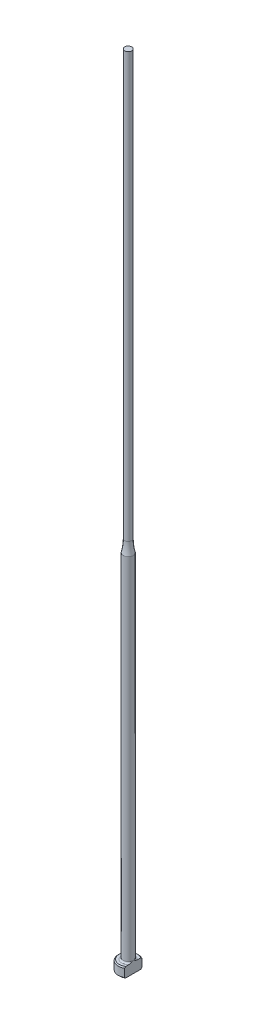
ISO-10303-21;
HEADER;
FILE_DESCRIPTION(('STEP AP214'),'2;1');
FILE_NAME('part.step','',(''),(''),'','','');
FILE_SCHEMA(('AUTOMOTIVE_DESIGN { 1 0 10303 214 1 1 1 1 }'));
ENDSEC;
DATA;
#1=APPLICATION_CONTEXT('core data for automotive mechanical design processes');
#2=APPLICATION_PROTOCOL_DEFINITION('international standard','automotive_design',2000,#1);
#3=PRODUCT_CONTEXT('',#1,'mechanical');
#4=PRODUCT('Part','Part','',(#3));
#5=PRODUCT_RELATED_PRODUCT_CATEGORY('part','',(#4));
#6=PRODUCT_DEFINITION_FORMATION('','',#4);
#7=PRODUCT_DEFINITION_CONTEXT('part definition',#1,'design');
#8=PRODUCT_DEFINITION('design','',#6,#7);
#9=PRODUCT_DEFINITION_SHAPE('','',#8);
#10=(LENGTH_UNIT() NAMED_UNIT(*) SI_UNIT(.MILLI.,.METRE.));
#11=(NAMED_UNIT(*) PLANE_ANGLE_UNIT() SI_UNIT($,.RADIAN.));
#12=(NAMED_UNIT(*) SI_UNIT($,.STERADIAN.) SOLID_ANGLE_UNIT());
#13=UNCERTAINTY_MEASURE_WITH_UNIT(LENGTH_MEASURE(1.E-05),#10,'distance_accuracy_value','');
#14=(GEOMETRIC_REPRESENTATION_CONTEXT(3) GLOBAL_UNCERTAINTY_ASSIGNED_CONTEXT((#13)) GLOBAL_UNIT_ASSIGNED_CONTEXT((#10,
#11,#12)) REPRESENTATION_CONTEXT('',''));
#15=CARTESIAN_POINT('',(0.,0.,0.));
#16=DIRECTION('',(0.,0.,1.));
#17=DIRECTION('',(1.,0.,0.));
#18=AXIS2_PLACEMENT_3D('',#15,#16,#17);
#19=CARTESIAN_POINT('',(-1.99999999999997,2.,0.));
#20=DIRECTION('',(0.,1.,0.));
#21=DIRECTION('',(0.,0.,1.));
#22=AXIS2_PLACEMENT_3D('',#19,#20,#21);
#23=PLANE('',#22);
#24=CARTESIAN_POINT('',(0.,2.,0.));
#25=DIRECTION('',(0.,1.,0.));
#26=DIRECTION('',(0.,0.,1.));
#27=AXIS2_PLACEMENT_3D('',#24,#25,#26);
#28=CIRCLE('',#27,1.79999999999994);
#29=CARTESIAN_POINT('',(0.999999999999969,2.,-1.49666295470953));
#30=VERTEX_POINT('',#29);
#31=CARTESIAN_POINT('',(0.999999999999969,2.,1.49666295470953));
#32=VERTEX_POINT('',#31);
#33=EDGE_CURVE('E187',#30,#32,#28,.T.);
#34=ORIENTED_EDGE('',*,*,#33,.T.);
#35=DIRECTION('',(0.,0.,-1.));
#36=VECTOR('',#35,1.);
#37=CARTESIAN_POINT('',(0.999999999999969,2.,0.));
#38=LINE('',#37,#36);
#39=CARTESIAN_POINT('',(0.999999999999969,2.00000000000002,0.830662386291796));
#40=VERTEX_POINT('',#39);
#41=EDGE_CURVE('E57',#32,#40,#38,.T.);
#42=ORIENTED_EDGE('',*,*,#41,.T.);
#43=CARTESIAN_POINT('',(0.,2.,0.));
#44=DIRECTION('',(0.,1.,0.));
#45=DIRECTION('',(0.,0.,1.));
#46=AXIS2_PLACEMENT_3D('',#43,#44,#45);
#47=CIRCLE('',#46,1.29999999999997);
#48=CARTESIAN_POINT('',(0.999999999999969,2.00000000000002,-0.830662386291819));
#49=VERTEX_POINT('',#48);
#50=EDGE_CURVE('E108',#40,#49,#47,.F.);
#51=ORIENTED_EDGE('',*,*,#50,.T.);
#52=EDGE_CURVE('E137',#49,#30,#38,.T.);
#53=ORIENTED_EDGE('',*,*,#52,.T.);
#54=EDGE_LOOP('',(#34,#42,#51,#53));
#55=FACE_BOUND('',#54,.T.);
#56=ADVANCED_FACE('F32',(#55),#23,.T.);
#57=CARTESIAN_POINT('',(0.,259.958771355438,0.));
#58=DIRECTION('',(0.,1.,0.));
#59=DIRECTION('',(0.,0.,1.));
#60=AXIS2_PLACEMENT_3D('',#57,#58,#59);
#61=CYLINDRICAL_SURFACE('',#60,1.99999999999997);
#62=CARTESIAN_POINT('',(0.,1.79999999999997,0.));
#63=DIRECTION('',(0.,1.,0.));
#64=DIRECTION('',(0.,0.,1.));
#65=AXIS2_PLACEMENT_3D('',#62,#63,#64);
#66=CIRCLE('',#65,1.99999999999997);
#67=CARTESIAN_POINT('',(0.999999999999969,1.79999999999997,1.73205080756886));
#68=VERTEX_POINT('',#67);
#69=CARTESIAN_POINT('',(0.999999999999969,1.79999999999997,-1.73205080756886));
#70=VERTEX_POINT('',#69);
#71=EDGE_CURVE('E105',#68,#70,#66,.F.);
#72=ORIENTED_EDGE('',*,*,#71,.T.);
#73=DIRECTION('',(0.,-1.,0.));
#74=VECTOR('',#73,1.);
#75=CARTESIAN_POINT('',(0.999999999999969,160.,-1.73205080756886));
#76=LINE('',#75,#74);
#77=CARTESIAN_POINT('',(0.999999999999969,0.199999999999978,-1.73205080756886));
#78=VERTEX_POINT('',#77);
#79=EDGE_CURVE('E193',#70,#78,#76,.T.);
#80=ORIENTED_EDGE('',*,*,#79,.T.);
#81=CARTESIAN_POINT('',(0.,0.199999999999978,0.));
#82=DIRECTION('',(0.,-1.,0.));
#83=DIRECTION('',(0.,0.,-1.));
#84=AXIS2_PLACEMENT_3D('',#81,#82,#83);
#85=CIRCLE('',#84,1.99999999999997);
#86=CARTESIAN_POINT('',(0.999999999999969,0.199999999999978,1.73205080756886));
#87=VERTEX_POINT('',#86);
#88=EDGE_CURVE('E100',#78,#87,#85,.F.);
#89=ORIENTED_EDGE('',*,*,#88,.T.);
#90=DIRECTION('',(0.,-1.,0.));
#91=VECTOR('',#90,1.);
#92=CARTESIAN_POINT('',(0.999999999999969,160.,1.73205080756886));
#93=LINE('',#92,#91);
#94=EDGE_CURVE('E93',#68,#87,#93,.T.);
#95=ORIENTED_EDGE('',*,*,#94,.F.);
#96=EDGE_LOOP('',(#72,#80,#89,#95));
#97=FACE_BOUND('',#96,.T.);
#98=ADVANCED_FACE('F158',(#97),#61,.T.);
#99=CARTESIAN_POINT('',(0.,0.,0.));
#100=DIRECTION('',(0.,-1.,0.));
#101=DIRECTION('',(0.,0.,-1.));
#102=AXIS2_PLACEMENT_3D('',#99,#100,#101);
#103=PLANE('',#102);
#104=CARTESIAN_POINT('',(0.,0.,0.));
#105=DIRECTION('',(0.,-1.,0.));
#106=DIRECTION('',(0.,0.,-1.));
#107=AXIS2_PLACEMENT_3D('',#104,#105,#106);
#108=CIRCLE('',#107,1.79999999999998);
#109=CARTESIAN_POINT('',(0.999999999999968,0.,1.49666295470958));
#110=VERTEX_POINT('',#109);
#111=CARTESIAN_POINT('',(0.999999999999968,0.,-1.49666295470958));
#112=VERTEX_POINT('',#111);
#113=EDGE_CURVE('E98',#110,#112,#108,.T.);
#114=ORIENTED_EDGE('',*,*,#113,.T.);
#115=DIRECTION('',(0.,0.,1.));
#116=VECTOR('',#115,1.);
#117=CARTESIAN_POINT('',(0.999999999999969,0.,-1.73205080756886));
#118=LINE('',#117,#116);
#119=EDGE_CURVE('E83',#112,#110,#118,.T.);
#120=ORIENTED_EDGE('',*,*,#119,.T.);
#121=EDGE_LOOP('',(#114,#120));
#122=FACE_BOUND('',#121,.T.);
#123=ADVANCED_FACE('F103',(#122),#103,.T.);
#124=CARTESIAN_POINT('',(0.,2.,0.));
#125=DIRECTION('',(0.,-1.,0.));
#126=DIRECTION('',(0.,0.,-1.));
#127=AXIS2_PLACEMENT_3D('',#124,#125,#126);
#128=CONICAL_SURFACE('',#127,1.79999999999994,0.785398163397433);
#129=ORIENTED_EDGE('',*,*,#71,.F.);
#130=CARTESIAN_POINT('',(0.999999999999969,-0.143084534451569,3.81417299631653));
#131=CARTESIAN_POINT('',(0.999999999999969,-0.0593997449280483,3.72765647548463));
#132=CARTESIAN_POINT('',(0.999999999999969,0.0241940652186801,3.64105173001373));
#133=CARTESIAN_POINT('',(0.999999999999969,0.191148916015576,3.46761616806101));
#134=CARTESIAN_POINT('',(0.999999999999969,0.274509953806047,3.3807853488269));
#135=CARTESIAN_POINT('',(0.999999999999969,0.524249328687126,3.11979400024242));
#136=CARTESIAN_POINT('',(0.999999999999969,0.690198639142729,2.94522254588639));
#137=CARTESIAN_POINT('',(0.999999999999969,1.01697550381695,2.59782670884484));
#138=CARTESIAN_POINT('',(0.999999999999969,1.17783928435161,2.42503661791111));
#139=CARTESIAN_POINT('',(0.999999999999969,1.41669118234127,2.16364984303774));
#140=CARTESIAN_POINT('',(0.999999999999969,1.49589273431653,2.07616357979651));
#141=CARTESIAN_POINT('',(0.999999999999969,1.65313803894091,1.90015721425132));
#142=CARTESIAN_POINT('',(0.999999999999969,1.73118183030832,1.81163714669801));
#143=CARTESIAN_POINT('',(0.999999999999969,1.85567318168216,1.66767927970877));
#144=CARTESIAN_POINT('',(0.999999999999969,1.90265415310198,1.61270332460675));
#145=CARTESIAN_POINT('',(0.999999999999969,1.99577882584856,1.50203557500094));
#146=CARTESIAN_POINT('',(0.999999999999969,2.04192244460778,1.44634371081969));
#147=CARTESIAN_POINT('',(0.999999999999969,2.13356596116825,1.33345480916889));
#148=CARTESIAN_POINT('',(0.999999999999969,2.17905399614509,1.2762481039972));
#149=CARTESIAN_POINT('',(0.999999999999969,2.26844283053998,1.16060976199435));
#150=CARTESIAN_POINT('',(0.999999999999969,2.3123437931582,1.10217825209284));
#151=CARTESIAN_POINT('',(0.999999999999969,2.39853453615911,0.982773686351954));
#152=CARTESIAN_POINT('',(0.999999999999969,2.44078986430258,0.921775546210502));
#153=CARTESIAN_POINT('',(0.999999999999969,2.52187810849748,0.797387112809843));
#154=CARTESIAN_POINT('',(0.999999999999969,2.56070631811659,0.733993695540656));
#155=CARTESIAN_POINT('',(0.999999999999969,2.6324859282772,0.604932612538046));
#156=CARTESIAN_POINT('',(0.999999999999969,2.66550424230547,0.539302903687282));
#157=CARTESIAN_POINT('',(0.999999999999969,2.72301550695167,0.404437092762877));
#158=CARTESIAN_POINT('',(0.999999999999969,2.74753707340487,0.335214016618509));
#159=CARTESIAN_POINT('',(0.999999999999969,2.77407110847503,0.231400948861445));
#160=CARTESIAN_POINT('',(0.999999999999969,2.78110742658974,0.198093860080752));
#161=CARTESIAN_POINT('',(0.999999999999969,2.79200506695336,0.130954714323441));
#162=CARTESIAN_POINT('',(0.999999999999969,2.7958666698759,0.0971227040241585));
#163=CARTESIAN_POINT('',(0.999999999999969,2.80013905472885,0.0293410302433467));
#164=CARTESIAN_POINT('',(0.999999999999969,2.80056046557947,-0.00460794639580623));
#165=CARTESIAN_POINT('',(0.999999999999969,2.79795882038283,-0.0723663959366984));
#166=CARTESIAN_POINT('',(0.999999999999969,2.79493547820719,-0.106175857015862));
#167=CARTESIAN_POINT('',(0.999999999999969,2.78105481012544,-0.206326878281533));
#168=CARTESIAN_POINT('',(0.999999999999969,2.76542146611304,-0.272037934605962));
#169=CARTESIAN_POINT('',(0.999999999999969,2.73477554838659,-0.368312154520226));
#170=CARTESIAN_POINT('',(0.999999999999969,2.72331063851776,-0.40012349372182));
#171=CARTESIAN_POINT('',(0.999999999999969,2.69840546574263,-0.46296441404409));
#172=CARTESIAN_POINT('',(0.999999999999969,2.68496560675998,-0.493994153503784));
#173=CARTESIAN_POINT('',(0.999999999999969,2.64209309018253,-0.586298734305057));
#174=CARTESIAN_POINT('',(0.999999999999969,2.61022871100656,-0.64643570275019));
#175=CARTESIAN_POINT('',(0.999999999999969,2.5422853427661,-0.764304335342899));
#176=CARTESIAN_POINT('',(0.999999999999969,2.50620119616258,-0.822032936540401));
#177=CARTESIAN_POINT('',(0.999999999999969,2.43107084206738,-0.935840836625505));
#178=CARTESIAN_POINT('',(0.999999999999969,2.39201347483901,-0.991912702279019));
#179=CARTESIAN_POINT('',(0.999999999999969,2.31195870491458,-1.10259849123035));
#180=CARTESIAN_POINT('',(0.999999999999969,2.27096226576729,-1.15721311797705));
#181=CARTESIAN_POINT('',(0.999999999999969,2.18701695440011,-1.26606869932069));
#182=CARTESIAN_POINT('',(0.999999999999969,2.14404946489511,-1.32029522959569));
#183=CARTESIAN_POINT('',(0.999999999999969,2.0570505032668,-1.4278898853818));
#184=CARTESIAN_POINT('',(0.999999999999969,2.01301896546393,-1.48125795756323));
#185=CARTESIAN_POINT('',(0.999999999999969,1.87995068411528,-1.64010952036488));
#186=CARTESIAN_POINT('',(0.999999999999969,1.78973357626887,-1.74460261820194));
#187=CARTESIAN_POINT('',(0.999999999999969,1.62290341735,-1.93426834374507));
#188=CARTESIAN_POINT('',(0.999999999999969,1.54658658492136,-2.01970404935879));
#189=CARTESIAN_POINT('',(0.999999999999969,1.39301250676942,-2.18973019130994));
#190=CARTESIAN_POINT('',(0.999999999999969,1.31575523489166,-2.27432060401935));
#191=CARTESIAN_POINT('',(0.999999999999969,1.08283440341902,-2.52732479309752));
#192=CARTESIAN_POINT('',(0.999999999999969,0.926165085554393,-2.69481086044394));
#193=CARTESIAN_POINT('',(0.999999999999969,0.617772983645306,-3.02147252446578));
#194=CARTESIAN_POINT('',(0.999999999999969,0.466111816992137,-3.18070657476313));
#195=CARTESIAN_POINT('',(0.999999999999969,0.238015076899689,-3.41880818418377));
#196=CARTESIAN_POINT('',(0.999999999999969,0.1619245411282,-3.49800657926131));
#197=CARTESIAN_POINT('',(0.999999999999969,0.00955322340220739,-3.65621892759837));
#198=CARTESIAN_POINT('',(0.999999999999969,-0.0667275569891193,-3.73523288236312));
#199=CARTESIAN_POINT('',(0.999999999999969,-0.14308453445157,-3.81417299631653));
#200=B_SPLINE_CURVE_WITH_KNOTS('',3,(#130,#131,#132,#133,#134,#135,#136,#137,#138,#139,#140,
#141,#142,#143,#144,#145,#146,#147,#148,#149,#150,#151,#152,#153,#154,#155,#156,#157,#158,#159,
#160,#161,#162,#163,#164,#165,#166,#167,#168,#169,#170,#171,#172,#173,#174,#175,#176,#177,#178,
#179,#180,#181,#182,#183,#184,#185,#186,#187,#188,#189,#190,#191,#192,#193,#194,#195,#196,#197,
#198,#199),.UNSPECIFIED.,.F.,.F.,(4,2,2,2,2,2,2,2,2,2,2,2,2,2,2,2,2,2,2,2,2,2,2,2,2,2,2,2,2,2,2,
2,2,2,4),(0.,0.36110162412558,0.722207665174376,1.44478731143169,2.15299784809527,
2.5070263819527,2.8610430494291,3.07798416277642,3.29494655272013,3.51418925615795,
3.73340935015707,3.95594813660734,4.17878792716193,4.39886399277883,4.61819150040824,
4.72018864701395,4.82217677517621,4.92384967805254,5.02553102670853,5.22698459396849,
5.32838854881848,5.4297717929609,5.63365200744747,5.837784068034,6.04272417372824,
6.24756349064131,6.45510395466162,6.66265726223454,7.07676259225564,7.42043039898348,
7.76410778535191,8.45210822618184,9.11180822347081,9.44129145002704,9.77077197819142),.UNSPECIFIED.);
#201=EDGE_CURVE('E136',#68,#32,#200,.T.);
#202=ORIENTED_EDGE('',*,*,#201,.T.);
#203=ORIENTED_EDGE('',*,*,#33,.F.);
#204=EDGE_CURVE('E128',#30,#70,#200,.T.);
#205=ORIENTED_EDGE('',*,*,#204,.T.);
#206=EDGE_LOOP('',(#129,#202,#203,#205));
#207=FACE_BOUND('',#206,.T.);
#208=ADVANCED_FACE('F144',(#207),#128,.T.);
#209=CARTESIAN_POINT('',(0.,0.199999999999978,0.));
#210=DIRECTION('',(0.,1.,0.));
#211=DIRECTION('',(0.,0.,1.));
#212=AXIS2_PLACEMENT_3D('',#209,#210,#211);
#213=CONICAL_SURFACE('',#212,1.99999999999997,0.785398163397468);
#214=ORIENTED_EDGE('',*,*,#88,.F.);
#215=CARTESIAN_POINT('',(0.999999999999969,2.14308453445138,-3.81417299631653));
#216=CARTESIAN_POINT('',(0.999999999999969,2.05939974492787,-3.72765647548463));
#217=CARTESIAN_POINT('',(0.999999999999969,1.97580593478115,-3.64105173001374));
#218=CARTESIAN_POINT('',(0.999999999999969,1.80885108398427,-3.46761616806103));
#219=CARTESIAN_POINT('',(0.999999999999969,1.72549004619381,-3.38078534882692));
#220=CARTESIAN_POINT('',(0.999999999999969,1.47575067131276,-3.11979400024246));
#221=CARTESIAN_POINT('',(0.999999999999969,1.30980136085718,-2.94522254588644));
#222=CARTESIAN_POINT('',(0.999999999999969,0.983024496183,-2.5978267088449));
#223=CARTESIAN_POINT('',(0.999999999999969,0.822160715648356,-2.42503661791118));
#224=CARTESIAN_POINT('',(0.999999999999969,0.583308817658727,-2.16364984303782));
#225=CARTESIAN_POINT('',(0.999999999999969,0.50410726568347,-2.0761635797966));
#226=CARTESIAN_POINT('',(0.999999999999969,0.346861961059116,-1.90015721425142));
#227=CARTESIAN_POINT('',(0.999999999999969,0.26881816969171,-1.81163714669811));
#228=CARTESIAN_POINT('',(0.999999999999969,0.144326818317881,-1.66767927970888));
#229=CARTESIAN_POINT('',(0.999999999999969,0.0973458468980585,-1.61270332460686));
#230=CARTESIAN_POINT('',(0.999999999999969,0.00422117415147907,-1.50203557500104));
#231=CARTESIAN_POINT('',(0.999999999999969,-0.0419224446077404,-1.44634371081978));
#232=CARTESIAN_POINT('',(0.999999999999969,-0.133565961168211,-1.33345480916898));
#233=CARTESIAN_POINT('',(0.999999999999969,-0.179053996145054,-1.27624810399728));
#234=CARTESIAN_POINT('',(0.999999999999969,-0.268442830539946,-1.16060976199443));
#235=CARTESIAN_POINT('',(0.999999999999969,-0.31234379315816,-1.10217825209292));
#236=CARTESIAN_POINT('',(0.999999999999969,-0.398534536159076,-0.982773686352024));
#237=CARTESIAN_POINT('',(0.999999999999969,-0.440789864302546,-0.92177554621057));
#238=CARTESIAN_POINT('',(0.999999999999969,-0.521878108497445,-0.797387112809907));
#239=CARTESIAN_POINT('',(0.999999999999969,-0.560706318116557,-0.733993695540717));
#240=CARTESIAN_POINT('',(0.999999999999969,-0.632485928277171,-0.604932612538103));
#241=CARTESIAN_POINT('',(0.999999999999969,-0.665504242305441,-0.539302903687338));
#242=CARTESIAN_POINT('',(0.999999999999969,-0.723015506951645,-0.404437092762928));
#243=CARTESIAN_POINT('',(0.999999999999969,-0.747537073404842,-0.335214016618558));
#244=CARTESIAN_POINT('',(0.999999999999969,-0.774071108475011,-0.231400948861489));
#245=CARTESIAN_POINT('',(0.999999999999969,-0.781107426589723,-0.198093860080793));
#246=CARTESIAN_POINT('',(0.999999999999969,-0.792005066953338,-0.130954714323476));
#247=CARTESIAN_POINT('',(0.999999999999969,-0.795866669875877,-0.0971227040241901));
#248=CARTESIAN_POINT('',(0.999999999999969,-0.800139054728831,-0.0293410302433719));
#249=CARTESIAN_POINT('',(0.999999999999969,-0.80056046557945,0.00460794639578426));
#250=CARTESIAN_POINT('',(0.999999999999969,-0.797958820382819,0.0723663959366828));
#251=CARTESIAN_POINT('',(0.999999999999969,-0.794935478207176,0.106175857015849));
#252=CARTESIAN_POINT('',(0.999999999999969,-0.781054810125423,0.20632687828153));
#253=CARTESIAN_POINT('',(0.999999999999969,-0.765421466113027,0.272037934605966));
#254=CARTESIAN_POINT('',(0.999999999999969,-0.734775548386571,0.36831215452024));
#255=CARTESIAN_POINT('',(0.999999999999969,-0.723310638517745,0.400123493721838));
#256=CARTESIAN_POINT('',(0.999999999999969,-0.698405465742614,0.462964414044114));
#257=CARTESIAN_POINT('',(0.999999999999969,-0.684965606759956,0.493994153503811));
#258=CARTESIAN_POINT('',(0.999999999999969,-0.642093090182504,0.586298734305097));
#259=CARTESIAN_POINT('',(0.999999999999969,-0.610228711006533,0.646435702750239));
#260=CARTESIAN_POINT('',(0.999999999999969,-0.542285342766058,0.764304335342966));
#261=CARTESIAN_POINT('',(0.999999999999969,-0.506201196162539,0.822032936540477));
#262=CARTESIAN_POINT('',(0.999999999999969,-0.431070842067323,0.935840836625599));
#263=CARTESIAN_POINT('',(0.999999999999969,-0.392013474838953,0.991912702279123));
#264=CARTESIAN_POINT('',(0.999999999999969,-0.311958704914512,1.10259849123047));
#265=CARTESIAN_POINT('',(0.999999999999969,-0.270962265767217,1.15721311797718));
#266=CARTESIAN_POINT('',(0.999999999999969,-0.187016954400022,1.26606869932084));
#267=CARTESIAN_POINT('',(0.999999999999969,-0.144049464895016,1.32029522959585));
#268=CARTESIAN_POINT('',(0.999999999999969,-0.0570505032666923,1.42788988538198));
#269=CARTESIAN_POINT('',(0.999999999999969,-0.0130189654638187,1.48125795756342));
#270=CARTESIAN_POINT('',(0.999999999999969,0.120049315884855,1.64010952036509));
#271=CARTESIAN_POINT('',(0.999999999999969,0.21026642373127,1.74460261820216));
#272=CARTESIAN_POINT('',(0.999999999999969,0.37709658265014,1.9342683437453));
#273=CARTESIAN_POINT('',(0.999999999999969,0.453413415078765,2.01970404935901));
#274=CARTESIAN_POINT('',(0.999999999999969,0.606987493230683,2.18973019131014));
#275=CARTESIAN_POINT('',(0.999999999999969,0.684244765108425,2.27432060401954));
#276=CARTESIAN_POINT('',(0.999999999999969,0.917165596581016,2.52732479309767));
#277=CARTESIAN_POINT('',(0.999999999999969,1.07383491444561,2.69481086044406));
#278=CARTESIAN_POINT('',(0.999999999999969,1.38222701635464,3.02147252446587));
#279=CARTESIAN_POINT('',(0.999999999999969,1.53388818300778,3.1807065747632));
#280=CARTESIAN_POINT('',(0.999999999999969,1.76198492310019,3.41880818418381));
#281=CARTESIAN_POINT('',(0.999999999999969,1.83807545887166,3.49800657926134));
#282=CARTESIAN_POINT('',(0.999999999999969,1.99044677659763,3.65621892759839));
#283=CARTESIAN_POINT('',(0.999999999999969,2.06672755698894,3.73523288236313));
#284=CARTESIAN_POINT('',(0.999999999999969,2.14308453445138,3.81417299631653));
#285=B_SPLINE_CURVE_WITH_KNOTS('',3,(#215,#216,#217,#218,#219,#220,#221,#222,#223,#224,#225,
#226,#227,#228,#229,#230,#231,#232,#233,#234,#235,#236,#237,#238,#239,#240,#241,#242,#243,#244,
#245,#246,#247,#248,#249,#250,#251,#252,#253,#254,#255,#256,#257,#258,#259,#260,#261,#262,#263,
#264,#265,#266,#267,#268,#269,#270,#271,#272,#273,#274,#275,#276,#277,#278,#279,#280,#281,#282,
#283,#284),.UNSPECIFIED.,.F.,.F.,(4,2,2,2,2,2,2,2,2,2,2,2,2,2,2,2,2,2,2,2,2,2,2,2,2,2,2,2,2,2,2,
2,2,2,4),(0.,0.36110162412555,0.722207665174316,1.44478731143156,2.15299784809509,
2.5070263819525,2.86104304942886,3.07798416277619,3.2949465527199,3.51418925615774,
3.73340935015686,3.95594813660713,4.17878792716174,4.39886399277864,4.61819150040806,
4.72018864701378,4.82217677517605,4.92384967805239,5.02553102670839,5.22698459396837,
5.32838854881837,5.4297717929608,5.6336520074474,5.83778406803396,6.04272417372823,
6.24756349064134,6.45510395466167,6.66265726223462,7.07676259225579,7.42043039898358,
7.76410778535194,8.45210822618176,9.11180822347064,9.44129145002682,9.77077197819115),.UNSPECIFIED.);
#286=EDGE_CURVE('E86',#78,#112,#285,.T.);
#287=ORIENTED_EDGE('',*,*,#286,.T.);
#288=ORIENTED_EDGE('',*,*,#113,.F.);
#289=EDGE_CURVE('E89',#110,#87,#285,.T.);
#290=ORIENTED_EDGE('',*,*,#289,.T.);
#291=EDGE_LOOP('',(#214,#287,#288,#290));
#292=FACE_BOUND('',#291,.T.);
#293=ADVANCED_FACE('F97',(#292),#213,.T.);
#294=CARTESIAN_POINT('',(0.,2.30000000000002,0.));
#295=DIRECTION('',(0.,1.,0.));
#296=DIRECTION('',(0.,0.,1.));
#297=AXIS2_PLACEMENT_3D('',#294,#295,#296);
#298=TOROIDAL_SURFACE('',#297,1.29999999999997,0.3);
#299=CARTESIAN_POINT('',(0.999999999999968,2.30000000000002,0.));
#300=CARTESIAN_POINT('',(0.999999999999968,2.30000064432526,8.6574445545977E-12));
#301=CARTESIAN_POINT('',(0.999999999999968,2.30000128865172,-9.05742231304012E-08));
#302=CARTESIAN_POINT('',(0.999999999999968,2.30000254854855,-3.98319620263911E-07));
#303=CARTESIAN_POINT('',(0.999999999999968,2.30000316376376,-6.16748313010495E-07));
#304=CARTESIAN_POINT('',(0.999999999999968,2.30000438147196,-1.15047367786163E-06));
#305=CARTESIAN_POINT('',(0.999999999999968,2.30000498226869,-1.46954564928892E-06));
#306=CARTESIAN_POINT('',(0.999999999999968,2.30000613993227,-2.17388585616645E-06));
#307=CARTESIAN_POINT('',(0.999999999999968,2.3000066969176,-2.55896592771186E-06));
#308=CARTESIAN_POINT('',(0.999999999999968,2.30000847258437,-3.89137454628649E-06));
#309=CARTESIAN_POINT('',(0.999999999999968,2.30000962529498,-4.9272569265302E-06));
#310=CARTESIAN_POINT('',(0.999999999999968,2.30001175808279,-7.12255376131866E-06));
#311=CARTESIAN_POINT('',(0.999999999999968,2.30001274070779,-8.27963246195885E-06));
#312=CARTESIAN_POINT('',(0.999999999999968,2.30001619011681,-1.25710396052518E-05));
#313=CARTESIAN_POINT('',(0.999999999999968,2.30001847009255,-1.58589994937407E-05));
#314=CARTESIAN_POINT('',(0.999999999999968,2.3000224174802,-2.25210462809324E-05));
#315=CARTESIAN_POINT('',(0.999999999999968,2.30002411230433,-2.58796667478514E-05));
#316=CARTESIAN_POINT('',(0.999999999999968,2.30003085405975,-3.94941957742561E-05));
#317=CARTESIAN_POINT('',(0.999999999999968,2.30003568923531,-4.98493079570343E-05));
#318=CARTESIAN_POINT('',(0.999999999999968,2.30004388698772,-6.96407730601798E-05));
#319=CARTESIAN_POINT('',(0.999999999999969,2.30004735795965,-7.903098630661E-05));
#320=CARTESIAN_POINT('',(0.999999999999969,2.30007348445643,-0.000144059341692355));
#321=CARTESIAN_POINT('',(0.999999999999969,2.30010510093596,-0.000195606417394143));
#322=CARTESIAN_POINT('',(0.999999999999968,2.30022061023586,-0.000391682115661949));
#323=CARTESIAN_POINT('',(0.999999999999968,2.3002978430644,-0.000539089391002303));
#324=CARTESIAN_POINT('',(0.999999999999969,2.30059433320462,-0.00109591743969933));
#325=CARTESIAN_POINT('',(0.999999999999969,2.30082052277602,-0.00150237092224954));
#326=CARTESIAN_POINT('',(0.999999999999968,2.30171558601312,-0.00311941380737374));
#327=CARTESIAN_POINT('',(0.999999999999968,2.30237677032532,-0.00433326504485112));
#328=CARTESIAN_POINT('',(0.999999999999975,2.31602135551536,-0.0293725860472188));
#329=CARTESIAN_POINT('',(0.99999999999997,2.32909104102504,-0.0531623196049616));
#330=CARTESIAN_POINT('',(0.999999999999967,2.35458080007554,-0.100088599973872));
#331=CARTESIAN_POINT('',(0.999999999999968,2.36700820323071,-0.123221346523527));
#332=CARTESIAN_POINT('',(0.999999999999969,2.39281545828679,-0.172044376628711));
#333=CARTESIAN_POINT('',(0.999999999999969,2.4061616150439,-0.197752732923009));
#334=CARTESIAN_POINT('',(0.999999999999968,2.4323541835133,-0.249714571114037));
#335=CARTESIAN_POINT('',(0.999999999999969,2.44519503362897,-0.27597087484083));
#336=CARTESIAN_POINT('',(0.999999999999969,2.46718175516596,-0.322864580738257));
#337=CARTESIAN_POINT('',(0.999999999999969,2.47650292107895,-0.34341923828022));
#338=CARTESIAN_POINT('',(0.999999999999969,2.49448113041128,-0.384761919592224));
#339=CARTESIAN_POINT('',(0.999999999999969,2.50313958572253,-0.405549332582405));
#340=CARTESIAN_POINT('',(0.999999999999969,2.5276434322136,-0.467585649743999));
#341=CARTESIAN_POINT('',(0.999999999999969,2.54239224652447,-0.509286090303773));
#342=CARTESIAN_POINT('',(0.999999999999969,2.56458900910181,-0.58349816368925));
#343=CARTESIAN_POINT('',(0.999999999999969,2.57294045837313,-0.61573699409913));
#344=CARTESIAN_POINT('',(0.999999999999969,2.58691787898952,-0.682155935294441));
#345=CARTESIAN_POINT('',(0.999999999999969,2.5924232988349,-0.716362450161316));
#346=CARTESIAN_POINT('',(0.999999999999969,2.59932200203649,-0.784996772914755));
#347=CARTESIAN_POINT('',(0.999999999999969,2.60074119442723,-0.819421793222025));
#348=CARTESIAN_POINT('',(0.999999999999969,2.59853032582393,-0.88779225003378));
#349=CARTESIAN_POINT('',(0.999999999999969,2.59495737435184,-0.921738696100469));
#350=CARTESIAN_POINT('',(0.999999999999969,2.58381038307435,-0.977927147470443));
#351=CARTESIAN_POINT('',(0.999999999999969,2.57785171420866,-1.00048693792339));
#352=CARTESIAN_POINT('',(0.999999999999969,2.56267132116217,-1.0445512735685));
#353=CARTESIAN_POINT('',(0.999999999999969,2.55344592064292,-1.06605459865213));
#354=CARTESIAN_POINT('',(0.999999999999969,2.53348156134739,-1.10327564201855));
#355=CARTESIAN_POINT('',(0.999999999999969,2.52335553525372,-1.11931996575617));
#356=CARTESIAN_POINT('',(0.999999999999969,2.50063930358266,-1.1495565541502));
#357=CARTESIAN_POINT('',(0.999999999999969,2.48805327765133,-1.16375189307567));
#358=CARTESIAN_POINT('',(0.999999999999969,2.46313284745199,-1.18709127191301));
#359=CARTESIAN_POINT('',(0.999999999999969,2.45121755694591,-1.19668155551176));
#360=CARTESIAN_POINT('',(0.999999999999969,2.4259612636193,-1.21377371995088));
#361=CARTESIAN_POINT('',(0.999999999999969,2.41262072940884,-1.2212762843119));
#362=CARTESIAN_POINT('',(0.999999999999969,2.38471163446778,-1.23381879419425));
#363=CARTESIAN_POINT('',(0.999999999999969,2.3701356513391,-1.23884240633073));
#364=CARTESIAN_POINT('',(0.999999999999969,2.34029120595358,-1.2460136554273));
#365=CARTESIAN_POINT('',(0.999999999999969,2.32502317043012,-1.24816304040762));
#366=CARTESIAN_POINT('',(0.999999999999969,2.29609418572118,-1.24936303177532));
#367=CARTESIAN_POINT('',(0.999999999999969,2.28244572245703,-1.24873511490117));
#368=CARTESIAN_POINT('',(0.999999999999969,2.25546467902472,-1.24513625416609));
#369=CARTESIAN_POINT('',(0.999999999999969,2.2421320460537,-1.24216570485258));
#370=CARTESIAN_POINT('',(0.999999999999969,2.21644742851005,-1.23414136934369));
#371=CARTESIAN_POINT('',(0.999999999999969,2.20408009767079,-1.22913614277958));
#372=CARTESIAN_POINT('',(0.999999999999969,2.18026539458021,-1.2172891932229));
#373=CARTESIAN_POINT('',(0.999999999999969,2.16881815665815,-1.21044720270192));
#374=CARTESIAN_POINT('',(0.999999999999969,2.14602713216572,-1.19450929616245));
#375=CARTESIAN_POINT('',(0.999999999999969,2.1347876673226,-1.18526487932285));
#376=CARTESIAN_POINT('',(0.999999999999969,2.11372805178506,-1.16528066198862));
#377=CARTESIAN_POINT('',(0.999999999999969,2.1039092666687,-1.15453944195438));
#378=CARTESIAN_POINT('',(0.999999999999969,2.08131380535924,-1.12639326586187));
#379=CARTESIAN_POINT('',(0.999999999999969,2.06941227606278,-1.10828305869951));
#380=CARTESIAN_POINT('',(0.999999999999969,2.04871157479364,-1.07041295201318));
#381=CARTESIAN_POINT('',(0.999999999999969,2.03991325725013,-1.05065259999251));
#382=CARTESIAN_POINT('',(0.999999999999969,2.02219264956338,-1.00203188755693));
#383=CARTESIAN_POINT('',(0.999999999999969,2.01461756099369,-0.972682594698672));
#384=CARTESIAN_POINT('',(0.999999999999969,2.00410660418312,-0.912914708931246));
#385=CARTESIAN_POINT('',(0.999999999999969,2.00122174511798,-0.882487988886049));
#386=CARTESIAN_POINT('',(0.999999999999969,1.99886242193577,-0.80318909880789));
#387=CARTESIAN_POINT('',(0.999999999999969,2.0024814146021,-0.754226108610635));
#388=CARTESIAN_POINT('',(0.999999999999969,2.01327071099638,-0.682724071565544));
#389=CARTESIAN_POINT('',(0.999999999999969,2.01762186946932,-0.659663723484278));
#390=CARTESIAN_POINT('',(0.999999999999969,2.02775671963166,-0.613959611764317));
#391=CARTESIAN_POINT('',(0.999999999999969,2.03353398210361,-0.59131445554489));
#392=CARTESIAN_POINT('',(0.999999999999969,2.05232003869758,-0.525222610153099));
#393=CARTESIAN_POINT('',(0.999999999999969,2.0670175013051,-0.482256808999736));
#394=CARTESIAN_POINT('',(0.999999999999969,2.09166172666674,-0.418361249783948));
#395=CARTESIAN_POINT('',(0.999999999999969,2.10040936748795,-0.396945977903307));
#396=CARTESIAN_POINT('',(0.999999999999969,2.11862724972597,-0.354367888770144));
#397=CARTESIAN_POINT('',(0.999999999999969,2.12809902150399,-0.33320572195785));
#398=CARTESIAN_POINT('',(0.999999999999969,2.15054796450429,-0.284809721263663));
#399=CARTESIAN_POINT('',(0.999999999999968,2.16372144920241,-0.257667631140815));
#400=CARTESIAN_POINT('',(0.999999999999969,2.19063957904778,-0.203972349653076));
#401=CARTESIAN_POINT('',(0.999999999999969,2.20437810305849,-0.177416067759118));
#402=CARTESIAN_POINT('',(0.999999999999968,2.23096755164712,-0.127000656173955));
#403=CARTESIAN_POINT('',(0.999999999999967,2.2437812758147,-0.103121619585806));
#404=CARTESIAN_POINT('',(0.99999999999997,2.27007504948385,-0.0546869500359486));
#405=CARTESIAN_POINT('',(0.999999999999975,2.28356304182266,-0.0301354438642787));
#406=CARTESIAN_POINT('',(0.999999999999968,2.29762327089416,-0.00433318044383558));
#407=CARTESIAN_POINT('',(0.999999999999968,2.29828450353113,-0.00311924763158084));
#408=CARTESIAN_POINT('',(0.999999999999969,2.29917957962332,-0.0015021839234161));
#409=CARTESIAN_POINT('',(0.999999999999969,2.2994057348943,-0.0010957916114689));
#410=CARTESIAN_POINT('',(0.999999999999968,2.29970218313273,-0.000539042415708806));
#411=CARTESIAN_POINT('',(0.999999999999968,2.29977940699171,-0.000391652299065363));
#412=CARTESIAN_POINT('',(0.999999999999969,2.29989490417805,-0.000195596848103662));
#413=CARTESIAN_POINT('',(0.999999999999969,2.2999265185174,-0.000144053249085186));
#414=CARTESIAN_POINT('',(0.999999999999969,2.29995264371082,-7.90290824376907E-05));
#415=CARTESIAN_POINT('',(0.999999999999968,2.29995611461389,-6.96391975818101E-05));
#416=CARTESIAN_POINT('',(0.999999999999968,2.29996431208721,-4.98484228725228E-05));
#417=CARTESIAN_POINT('',(0.999999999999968,2.29996914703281,-3.94936645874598E-05));
#418=CARTESIAN_POINT('',(0.999999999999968,2.29997588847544,-2.587953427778E-05));
#419=CARTESIAN_POINT('',(0.999999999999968,2.29997758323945,-2.25209724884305E-05));
#420=CARTESIAN_POINT('',(0.999999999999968,2.29998153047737,-1.58590310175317E-05));
#421=CARTESIAN_POINT('',(0.999999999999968,2.29998381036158,-1.25711163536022E-05));
#422=CARTESIAN_POINT('',(0.999999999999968,2.29998725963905,-8.27974911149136E-06));
#423=CARTESIAN_POINT('',(0.999999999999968,2.29998824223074,-7.122675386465E-06));
#424=CARTESIAN_POINT('',(0.999999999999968,2.29999037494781,-4.92738159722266E-06));
#425=CARTESIAN_POINT('',(0.999999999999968,2.29999152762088,-3.89149712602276E-06));
#426=CARTESIAN_POINT('',(0.999999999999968,2.29999330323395,-2.5590774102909E-06));
#427=CARTESIAN_POINT('',(0.999999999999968,2.29999386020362,-2.17399250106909E-06));
#428=CARTESIAN_POINT('',(0.999999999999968,2.29999501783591,-1.4696398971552E-06));
#429=CARTESIAN_POINT('',(0.999999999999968,2.299995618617,-1.15056035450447E-06));
#430=CARTESIAN_POINT('',(0.999999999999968,2.29999683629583,-6.16816558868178E-07));
#431=CARTESIAN_POINT('',(0.999999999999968,2.29999745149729,-3.98377208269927E-07));
#432=CARTESIAN_POINT('',(0.999999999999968,2.29999871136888,-9.06063088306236E-08));
#433=CARTESIAN_POINT('',(0.999999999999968,2.29999935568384,-8.657323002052E-12));
#434=CARTESIAN_POINT('',(0.999999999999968,2.30000000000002,0.));
#435=B_SPLINE_CURVE_WITH_KNOTS('',3,(#299,#300,#301,#302,#303,#304,#305,#306,#307,#308,#309,
#310,#311,#312,#313,#314,#315,#316,#317,#318,#319,#320,#321,#322,#323,#324,#325,#326,#327,#328,
#329,#330,#331,#332,#333,#334,#335,#336,#337,#338,#339,#340,#341,#342,#343,#344,#345,#346,#347,
#348,#349,#350,#351,#352,#353,#354,#355,#356,#357,#358,#359,#360,#361,#362,#363,#364,#365,#366,
#367,#368,#369,#370,#371,#372,#373,#374,#375,#376,#377,#378,#379,#380,#381,#382,#383,#384,#385,
#386,#387,#388,#389,#390,#391,#392,#393,#394,#395,#396,#397,#398,#399,#400,#401,#402,#403,#404,
#405,#406,#407,#408,#409,#410,#411,#412,#413,#414,#415,#416,#417,#418,#419,#420,#421,#422,#423,
#424,#425,#426,#427,#428,#429,#430,#431,#432,#433,#434),.UNSPECIFIED.,.T.,.F.,(4,2,2,2,2,2,2,2,
2,2,2,2,2,2,2,2,2,2,2,2,2,2,2,2,2,2,2,2,2,2,2,2,2,2,2,2,2,2,2,2,2,2,2,2,2,2,2,2,2,2,2,2,2,2,2,2,
2,2,2,2,2,2,2,2,2,2,2,4),(0.,1.93088000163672E-06,3.88121487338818E-06,5.91576027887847E-06,
7.94459959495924E-06,1.25713540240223E-05,1.71213138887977E-05,2.9075120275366E-05,
4.0350817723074E-05,7.46190414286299E-05,0.000104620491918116,0.00028499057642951,
0.000785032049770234,0.00217951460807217,0.00632720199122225,0.0877445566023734,
0.166524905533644,0.253417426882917,0.341089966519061,0.408787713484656,0.476336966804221,
0.608850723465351,0.708652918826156,0.812393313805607,0.915474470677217,1.01738599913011,
1.08718721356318,1.15706723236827,1.21377727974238,1.27039179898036,1.31609373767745,
1.36178069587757,1.40776478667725,1.4537208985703,1.49450576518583,1.5352837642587,
1.57514089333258,1.61500383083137,1.65849635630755,1.70203041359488,1.76667915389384,
1.83134568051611,1.92177629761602,2.0131839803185,2.15955153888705,2.22993031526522,
2.29999742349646,2.43600819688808,2.50540041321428,2.57494356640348,2.66544006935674,
2.75513178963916,2.83643278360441,2.92045687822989,2.92460484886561,2.92599912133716,
2.926499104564,2.92667946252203,2.92670946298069,2.92674372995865,2.92675500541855,
2.92676695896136,2.92677150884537,2.92677613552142,2.92677816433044,2.92678019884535,
2.92678214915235,2.92678408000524),.UNSPECIFIED.);
#436=CARTESIAN_POINT('',(0.999999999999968,2.30000000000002,0.));
#437=VERTEX_POINT('',#436);
#438=EDGE_CURVE('E11',#49,#437,#435,.T.);
#439=ORIENTED_EDGE('',*,*,#438,.F.);
#440=ORIENTED_EDGE('',*,*,#50,.F.);
#441=CARTESIAN_POINT('',(0.999999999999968,2.30000000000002,0.));
#442=CARTESIAN_POINT('',(0.999999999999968,2.29999935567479,-8.65741696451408E-12));
#443=CARTESIAN_POINT('',(0.999999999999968,2.29999871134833,9.05742231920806E-08));
#444=CARTESIAN_POINT('',(0.999999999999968,2.2999974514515,3.98319620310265E-07));
#445=CARTESIAN_POINT('',(0.999999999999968,2.29999683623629,6.16748313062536E-07));
#446=CARTESIAN_POINT('',(0.999999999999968,2.29999561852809,1.15047367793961E-06));
#447=CARTESIAN_POINT('',(0.999999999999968,2.29999501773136,1.46954564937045E-06));
#448=CARTESIAN_POINT('',(0.999999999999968,2.29999386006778,2.17388585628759E-06));
#449=CARTESIAN_POINT('',(0.999999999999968,2.29999330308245,2.55896592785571E-06));
#450=CARTESIAN_POINT('',(0.999999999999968,2.29999152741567,3.89137454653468E-06));
#451=CARTESIAN_POINT('',(0.999999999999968,2.29999037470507,4.92725692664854E-06));
#452=CARTESIAN_POINT('',(0.999999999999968,2.29998824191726,7.12255376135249E-06));
#453=CARTESIAN_POINT('',(0.999999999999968,2.29998725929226,8.27963246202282E-06));
#454=CARTESIAN_POINT('',(0.999999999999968,2.29998380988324,1.25710396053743E-05));
#455=CARTESIAN_POINT('',(0.999999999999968,2.2999815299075,1.58589994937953E-05));
#456=CARTESIAN_POINT('',(0.999999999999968,2.29997758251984,2.25210462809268E-05));
#457=CARTESIAN_POINT('',(0.999999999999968,2.29997588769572,2.58796667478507E-05));
#458=CARTESIAN_POINT('',(0.999999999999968,2.29996914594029,3.94941957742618E-05));
#459=CARTESIAN_POINT('',(0.999999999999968,2.29996431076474,4.98493079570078E-05));
#460=CARTESIAN_POINT('',(0.999999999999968,2.29995611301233,6.96407730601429E-05));
#461=CARTESIAN_POINT('',(0.999999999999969,2.2999526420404,7.90309863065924E-05));
#462=CARTESIAN_POINT('',(0.999999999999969,2.29992651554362,0.000144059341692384));
#463=CARTESIAN_POINT('',(0.999999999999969,2.29989489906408,0.000195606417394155));
#464=CARTESIAN_POINT('',(0.999999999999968,2.29977938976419,0.000391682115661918));
#465=CARTESIAN_POINT('',(0.999999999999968,2.29970215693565,0.000539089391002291));
#466=CARTESIAN_POINT('',(0.999999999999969,2.29940566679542,0.00109591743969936));
#467=CARTESIAN_POINT('',(0.999999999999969,2.29917947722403,0.00150237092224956));
#468=CARTESIAN_POINT('',(0.999999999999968,2.29828441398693,0.0031194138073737));
#469=CARTESIAN_POINT('',(0.999999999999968,2.29762322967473,0.0043332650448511));
#470=CARTESIAN_POINT('',(0.999999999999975,2.28397864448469,0.0293725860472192));
#471=CARTESIAN_POINT('',(0.99999999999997,2.27090895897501,0.0531623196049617));
#472=CARTESIAN_POINT('',(0.999999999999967,2.24541919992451,0.100088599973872));
#473=CARTESIAN_POINT('',(0.999999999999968,2.23299179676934,0.123221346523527));
#474=CARTESIAN_POINT('',(0.999999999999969,2.20718454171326,0.172044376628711));
#475=CARTESIAN_POINT('',(0.999999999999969,2.19383838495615,0.197752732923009));
#476=CARTESIAN_POINT('',(0.999999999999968,2.16764581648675,0.249714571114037));
#477=CARTESIAN_POINT('',(0.999999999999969,2.15480496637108,0.27597087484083));
#478=CARTESIAN_POINT('',(0.999999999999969,2.13281824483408,0.322864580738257));
#479=CARTESIAN_POINT('',(0.999999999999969,2.1234970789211,0.34341923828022));
#480=CARTESIAN_POINT('',(0.999999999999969,2.10551886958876,0.384761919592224));
#481=CARTESIAN_POINT('',(0.999999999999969,2.09686041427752,0.405549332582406));
#482=CARTESIAN_POINT('',(0.999999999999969,2.07235656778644,0.467585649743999));
#483=CARTESIAN_POINT('',(0.999999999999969,2.05760775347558,0.509286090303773));
#484=CARTESIAN_POINT('',(0.999999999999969,2.03541099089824,0.58349816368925));
#485=CARTESIAN_POINT('',(0.999999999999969,2.02705954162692,0.61573699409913));
#486=CARTESIAN_POINT('',(0.999999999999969,2.01308212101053,0.682155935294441));
#487=CARTESIAN_POINT('',(0.999999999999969,2.00757670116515,0.716362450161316));
#488=CARTESIAN_POINT('',(0.999999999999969,2.00067799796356,0.784996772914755));
#489=CARTESIAN_POINT('',(0.999999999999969,1.99925880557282,0.819421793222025));
#490=CARTESIAN_POINT('',(0.999999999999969,2.00146967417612,0.88779225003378));
#491=CARTESIAN_POINT('',(0.999999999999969,2.00504262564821,0.921738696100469));
#492=CARTESIAN_POINT('',(0.999999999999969,2.0161896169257,0.977927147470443));
#493=CARTESIAN_POINT('',(0.999999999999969,2.02214828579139,1.00048693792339));
#494=CARTESIAN_POINT('',(0.999999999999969,2.03732867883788,1.0445512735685));
#495=CARTESIAN_POINT('',(0.999999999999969,2.04655407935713,1.06605459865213));
#496=CARTESIAN_POINT('',(0.999999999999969,2.06651843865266,1.10327564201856));
#497=CARTESIAN_POINT('',(0.999999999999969,2.07664446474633,1.11931996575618));
#498=CARTESIAN_POINT('',(0.999999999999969,2.09936069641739,1.14955655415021));
#499=CARTESIAN_POINT('',(0.999999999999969,2.11194672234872,1.16375189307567));
#500=CARTESIAN_POINT('',(0.999999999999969,2.13686715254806,1.18709127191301));
#501=CARTESIAN_POINT('',(0.999999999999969,2.14878244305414,1.19668155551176));
#502=CARTESIAN_POINT('',(0.999999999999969,2.17403873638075,1.21377371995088));
#503=CARTESIAN_POINT('',(0.999999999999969,2.18737927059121,1.2212762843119));
#504=CARTESIAN_POINT('',(0.999999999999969,2.21528836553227,1.23381879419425));
#505=CARTESIAN_POINT('',(0.999999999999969,2.22986434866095,1.23884240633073));
#506=CARTESIAN_POINT('',(0.999999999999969,2.25970879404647,1.2460136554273));
#507=CARTESIAN_POINT('',(0.999999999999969,2.27497682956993,1.24816304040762));
#508=CARTESIAN_POINT('',(0.999999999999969,2.30390581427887,1.24936303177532));
#509=CARTESIAN_POINT('',(0.999999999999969,2.31755427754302,1.24873511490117));
#510=CARTESIAN_POINT('',(0.999999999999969,2.34453532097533,1.24513625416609));
#511=CARTESIAN_POINT('',(0.999999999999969,2.35786795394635,1.24216570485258));
#512=CARTESIAN_POINT('',(0.999999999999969,2.38355257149,1.23414136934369));
#513=CARTESIAN_POINT('',(0.999999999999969,2.39591990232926,1.22913614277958));
#514=CARTESIAN_POINT('',(0.999999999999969,2.41973460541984,1.2172891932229));
#515=CARTESIAN_POINT('',(0.999999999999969,2.4311818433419,1.21044720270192));
#516=CARTESIAN_POINT('',(0.999999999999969,2.45397286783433,1.19450929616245));
#517=CARTESIAN_POINT('',(0.999999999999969,2.46521233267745,1.18526487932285));
#518=CARTESIAN_POINT('',(0.999999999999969,2.48627194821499,1.16528066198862));
#519=CARTESIAN_POINT('',(0.999999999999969,2.49609073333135,1.15453944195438));
#520=CARTESIAN_POINT('',(0.999999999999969,2.51868619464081,1.12639326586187));
#521=CARTESIAN_POINT('',(0.999999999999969,2.53058772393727,1.10828305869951));
#522=CARTESIAN_POINT('',(0.999999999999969,2.55128842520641,1.07041295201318));
#523=CARTESIAN_POINT('',(0.999999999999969,2.56008674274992,1.05065259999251));
#524=CARTESIAN_POINT('',(0.999999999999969,2.57780735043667,1.00203188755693));
#525=CARTESIAN_POINT('',(0.999999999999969,2.58538243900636,0.972682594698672));
#526=CARTESIAN_POINT('',(0.999999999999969,2.59589339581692,0.912914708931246));
#527=CARTESIAN_POINT('',(0.999999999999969,2.59877825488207,0.882487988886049));
#528=CARTESIAN_POINT('',(0.999999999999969,2.60113757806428,0.80318909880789));
#529=CARTESIAN_POINT('',(0.999999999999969,2.59751858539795,0.754226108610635));
#530=CARTESIAN_POINT('',(0.999999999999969,2.58672928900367,0.682724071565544));
#531=CARTESIAN_POINT('',(0.999999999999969,2.58237813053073,0.659663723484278));
#532=CARTESIAN_POINT('',(0.999999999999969,2.57224328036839,0.613959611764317));
#533=CARTESIAN_POINT('',(0.999999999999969,2.56646601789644,0.59131445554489));
#534=CARTESIAN_POINT('',(0.999999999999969,2.54767996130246,0.525222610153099));
#535=CARTESIAN_POINT('',(0.999999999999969,2.53298249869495,0.482256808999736));
#536=CARTESIAN_POINT('',(0.999999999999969,2.50833827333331,0.418361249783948));
#537=CARTESIAN_POINT('',(0.999999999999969,2.49959063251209,0.396945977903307));
#538=CARTESIAN_POINT('',(0.999999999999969,2.48137275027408,0.354367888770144));
#539=CARTESIAN_POINT('',(0.999999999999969,2.47190097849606,0.33320572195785));
#540=CARTESIAN_POINT('',(0.999999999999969,2.44945203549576,0.284809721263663));
#541=CARTESIAN_POINT('',(0.999999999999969,2.43627855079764,0.257667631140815));
#542=CARTESIAN_POINT('',(0.999999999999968,2.40936042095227,0.203972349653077));
#543=CARTESIAN_POINT('',(0.999999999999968,2.39562189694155,0.177416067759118));
#544=CARTESIAN_POINT('',(0.999999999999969,2.36903244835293,0.127000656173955));
#545=CARTESIAN_POINT('',(0.999999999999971,2.35621872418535,0.103121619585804));
#546=CARTESIAN_POINT('',(0.999999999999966,2.32992495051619,0.0546869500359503));
#547=CARTESIAN_POINT('',(0.999999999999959,2.31643695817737,0.0301354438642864));
#548=CARTESIAN_POINT('',(0.999999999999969,2.30237672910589,0.0043331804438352));
#549=CARTESIAN_POINT('',(0.99999999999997,2.30171549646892,0.00311924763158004));
#550=CARTESIAN_POINT('',(0.999999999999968,2.30082042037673,0.00150218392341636));
#551=CARTESIAN_POINT('',(0.999999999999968,2.30059426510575,0.00109579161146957));
#552=CARTESIAN_POINT('',(0.999999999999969,2.30029781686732,0.000539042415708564));
#553=CARTESIAN_POINT('',(0.999999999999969,2.30022059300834,0.000391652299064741));
#554=CARTESIAN_POINT('',(0.999999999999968,2.300105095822,0.000195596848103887));
#555=CARTESIAN_POINT('',(0.999999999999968,2.30007348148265,0.000144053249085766));
#556=CARTESIAN_POINT('',(0.999999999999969,2.30004735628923,7.90290824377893E-05));
#557=CARTESIAN_POINT('',(0.999999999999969,2.30004388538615,6.96391975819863E-05));
#558=CARTESIAN_POINT('',(0.999999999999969,2.30003568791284,4.98484228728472E-05));
#559=CARTESIAN_POINT('',(0.999999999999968,2.30003085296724,3.9493664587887E-05));
#560=CARTESIAN_POINT('',(0.999999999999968,2.30002411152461,2.5879534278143E-05));
#561=CARTESIAN_POINT('',(0.999999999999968,2.3000224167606,2.25209724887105E-05));
#562=CARTESIAN_POINT('',(0.999999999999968,2.30001846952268,1.58590310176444E-05));
#563=CARTESIAN_POINT('',(0.999999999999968,2.30001618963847,1.25711163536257E-05));
#564=CARTESIAN_POINT('',(0.999999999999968,2.300012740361,8.27974911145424E-06));
#565=CARTESIAN_POINT('',(0.999999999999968,2.30001175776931,7.12267538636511E-06));
#566=CARTESIAN_POINT('',(0.999999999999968,2.30000962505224,4.92738159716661E-06));
#567=CARTESIAN_POINT('',(0.999999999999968,2.30000847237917,3.89149712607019E-06));
#568=CARTESIAN_POINT('',(0.999999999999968,2.3000066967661,2.55907741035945E-06));
#569=CARTESIAN_POINT('',(0.999999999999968,2.30000613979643,2.17399250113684E-06));
#570=CARTESIAN_POINT('',(0.999999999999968,2.30000498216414,1.46963989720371E-06));
#571=CARTESIAN_POINT('',(0.999999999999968,2.30000438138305,1.15056035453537E-06));
#572=CARTESIAN_POINT('',(0.999999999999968,2.30000316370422,6.16816558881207E-07));
#573=CARTESIAN_POINT('',(0.999999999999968,2.30000254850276,3.98377208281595E-07));
#574=CARTESIAN_POINT('',(0.999999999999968,2.30000128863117,9.06063088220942E-08));
#575=CARTESIAN_POINT('',(0.999999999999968,2.30000064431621,8.65729541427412E-12));
#576=CARTESIAN_POINT('',(0.999999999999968,2.30000000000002,0.));
#577=B_SPLINE_CURVE_WITH_KNOTS('',3,(#441,#442,#443,#444,#445,#446,#447,#448,#449,#450,#451,
#452,#453,#454,#455,#456,#457,#458,#459,#460,#461,#462,#463,#464,#465,#466,#467,#468,#469,#470,
#471,#472,#473,#474,#475,#476,#477,#478,#479,#480,#481,#482,#483,#484,#485,#486,#487,#488,#489,
#490,#491,#492,#493,#494,#495,#496,#497,#498,#499,#500,#501,#502,#503,#504,#505,#506,#507,#508,
#509,#510,#511,#512,#513,#514,#515,#516,#517,#518,#519,#520,#521,#522,#523,#524,#525,#526,#527,
#528,#529,#530,#531,#532,#533,#534,#535,#536,#537,#538,#539,#540,#541,#542,#543,#544,#545,#546,
#547,#548,#549,#550,#551,#552,#553,#554,#555,#556,#557,#558,#559,#560,#561,#562,#563,#564,#565,
#566,#567,#568,#569,#570,#571,#572,#573,#574,#575,#576),.UNSPECIFIED.,.T.,.F.,(4,2,2,2,2,2,2,2,
2,2,2,2,2,2,2,2,2,2,2,2,2,2,2,2,2,2,2,2,2,2,2,2,2,2,2,2,2,2,2,2,2,2,2,2,2,2,2,2,2,2,2,2,2,2,2,2,
2,2,2,2,2,2,2,2,2,2,2,4),(0.,1.93088000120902E-06,3.88121487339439E-06,5.91576027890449E-06,
7.94459959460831E-06,1.2571354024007E-05,1.71213138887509E-05,2.90751202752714E-05,
4.03508177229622E-05,7.46190414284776E-05,0.000104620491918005,0.000284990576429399,
0.000785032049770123,0.00217951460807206,0.00632720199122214,0.0877445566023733,
0.166524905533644,0.253417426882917,0.341089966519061,0.408787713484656,0.476336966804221,
0.608850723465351,0.708652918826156,0.812393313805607,0.915474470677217,1.01738599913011,
1.08718721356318,1.15706723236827,1.21377727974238,1.27039179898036,1.31609373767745,
1.36178069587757,1.40776478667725,1.4537208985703,1.49450576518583,1.5352837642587,
1.57514089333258,1.61500383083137,1.65849635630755,1.70203041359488,1.76667915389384,
1.83134568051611,1.92177629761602,2.0131839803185,2.15955153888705,2.22993031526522,
2.29999742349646,2.43600819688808,2.50540041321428,2.57494356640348,2.66544006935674,
2.75513178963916,2.83643278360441,2.92045687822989,2.92460484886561,2.92599912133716,
2.926499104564,2.92667946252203,2.92670946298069,2.92674372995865,2.92675500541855,
2.92676695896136,2.92677150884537,2.92677613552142,2.92677816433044,2.92678019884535,
2.92678214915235,2.92678408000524),.UNSPECIFIED.);
#578=EDGE_CURVE('E46',#437,#40,#577,.T.);
#579=ORIENTED_EDGE('',*,*,#578,.F.);
#580=CARTESIAN_POINT('',(0.,2.30000000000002,0.));
#581=DIRECTION('',(0.,1.,0.));
#582=DIRECTION('',(0.,0.,1.));
#583=AXIS2_PLACEMENT_3D('',#580,#581,#582);
#584=CIRCLE('',#583,0.999999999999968);
#585=EDGE_CURVE('E104',#437,#437,#584,.T.);
#586=ORIENTED_EDGE('',*,*,#585,.F.);
#587=EDGE_LOOP('',(#439,#440,#579,#586));
#588=FACE_BOUND('',#587,.T.);
#589=ADVANCED_FACE('F34',(#588),#298,.F.);
#590=CARTESIAN_POINT('',(-0.699999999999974,160.,0.));
#591=DIRECTION('',(0.,1.,0.));
#592=DIRECTION('',(0.,0.,1.));
#593=AXIS2_PLACEMENT_3D('',#590,#591,#592);
#594=PLANE('',#593);
#595=CARTESIAN_POINT('',(0.,160.,0.));
#596=DIRECTION('',(0.,1.,0.));
#597=DIRECTION('',(0.,0.,1.));
#598=AXIS2_PLACEMENT_3D('',#595,#596,#597);
#599=CIRCLE('',#598,0.699999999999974);
#600=CARTESIAN_POINT('',(0.,160.,0.699999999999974));
#601=VERTEX_POINT('',#600);
#602=EDGE_CURVE('E186',#601,#601,#599,.T.);
#603=ORIENTED_EDGE('',*,*,#602,.T.);
#604=EDGE_LOOP('',(#603));
#605=FACE_BOUND('',#604,.T.);
#606=ADVANCED_FACE('F149',(#605),#594,.T.);
#607=CARTESIAN_POINT('',(0.,259.958771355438,0.));
#608=DIRECTION('',(0.,1.,0.));
#609=DIRECTION('',(0.,0.,1.));
#610=AXIS2_PLACEMENT_3D('',#607,#608,#609);
#611=CYLINDRICAL_SURFACE('',#610,0.699999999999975);
#612=CARTESIAN_POINT('',(0.,75.,0.));
#613=DIRECTION('',(0.,1.,0.));
#614=DIRECTION('',(0.,0.,1.));
#615=AXIS2_PLACEMENT_3D('',#612,#613,#614);
#616=CIRCLE('',#615,0.699999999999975);
#617=CARTESIAN_POINT('',(0.,75.,0.699999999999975));
#618=VERTEX_POINT('',#617);
#619=EDGE_CURVE('E183',#618,#618,#616,.T.);
#620=ORIENTED_EDGE('',*,*,#619,.T.);
#621=EDGE_LOOP('',(#620));
#622=FACE_BOUND('',#621,.T.);
#623=ORIENTED_EDGE('',*,*,#602,.F.);
#624=EDGE_LOOP('',(#623));
#625=FACE_BOUND('',#624,.T.);
#626=ADVANCED_FACE('F172',(#622,#625),#611,.T.);
#627=CARTESIAN_POINT('',(0.,75.,0.));
#628=DIRECTION('',(0.,1.,0.));
#629=DIRECTION('',(0.,0.,1.));
#630=AXIS2_PLACEMENT_3D('',#627,#628,#629);
#631=TOROIDAL_SURFACE('',#630,10.7,10.);
#632=CARTESIAN_POINT('',(0.,72.5689508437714,0.));
#633=DIRECTION('',(0.,1.,0.));
#634=DIRECTION('',(0.,0.,1.));
#635=AXIS2_PLACEMENT_3D('',#632,#633,#634);
#636=CIRCLE('',#635,0.999999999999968);
#637=CARTESIAN_POINT('',(0.,72.5689508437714,0.999999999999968));
#638=VERTEX_POINT('',#637);
#639=EDGE_CURVE('E101',#638,#638,#636,.T.);
#640=ORIENTED_EDGE('',*,*,#639,.T.);
#641=EDGE_LOOP('',(#640));
#642=FACE_BOUND('',#641,.T.);
#643=ORIENTED_EDGE('',*,*,#619,.F.);
#644=EDGE_LOOP('',(#643));
#645=FACE_BOUND('',#644,.T.);
#646=ADVANCED_FACE('F169',(#642,#645),#631,.F.);
#647=CARTESIAN_POINT('',(0.,259.958771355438,0.));
#648=DIRECTION('',(0.,1.,0.));
#649=DIRECTION('',(0.,0.,1.));
#650=AXIS2_PLACEMENT_3D('',#647,#648,#649);
#651=CYLINDRICAL_SURFACE('',#650,0.999999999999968);
#652=ORIENTED_EDGE('',*,*,#585,.T.);
#653=EDGE_LOOP('',(#652));
#654=FACE_BOUND('',#653,.T.);
#655=ORIENTED_EDGE('',*,*,#639,.F.);
#656=EDGE_LOOP('',(#655));
#657=FACE_BOUND('',#656,.T.);
#658=ADVANCED_FACE('F122',(#654,#657),#651,.T.);
#659=CARTESIAN_POINT('',(0.999999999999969,160.,-1.73205080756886));
#660=DIRECTION('',(1.,0.,0.));
#661=DIRECTION('',(0.,0.,-1.));
#662=AXIS2_PLACEMENT_3D('',#659,#660,#661);
#663=PLANE('',#662);
#664=ORIENTED_EDGE('',*,*,#79,.F.);
#665=ORIENTED_EDGE('',*,*,#204,.F.);
#666=ORIENTED_EDGE('',*,*,#52,.F.);
#667=ORIENTED_EDGE('',*,*,#438,.T.);
#668=ORIENTED_EDGE('',*,*,#578,.T.);
#669=ORIENTED_EDGE('',*,*,#41,.F.);
#670=ORIENTED_EDGE('',*,*,#201,.F.);
#671=ORIENTED_EDGE('',*,*,#94,.T.);
#672=ORIENTED_EDGE('',*,*,#289,.F.);
#673=ORIENTED_EDGE('',*,*,#119,.F.);
#674=ORIENTED_EDGE('',*,*,#286,.F.);
#675=EDGE_LOOP('',(#664,#665,#666,#667,#668,#669,#670,#671,#672,#673,#674));
#676=FACE_BOUND('',#675,.T.);
#677=ADVANCED_FACE('F85',(#676),#663,.T.);
#678=CLOSED_SHELL('',(#56,#98,#123,#208,#293,#589,#606,#626,#646,#658,#677));
#679=MANIFOLD_SOLID_BREP('B2',#678);
#680=ADVANCED_BREP_SHAPE_REPRESENTATION('',(#18,#679),#14);
#681=SHAPE_DEFINITION_REPRESENTATION(#9,#680);
ENDSEC;
END-ISO-10303-21;
